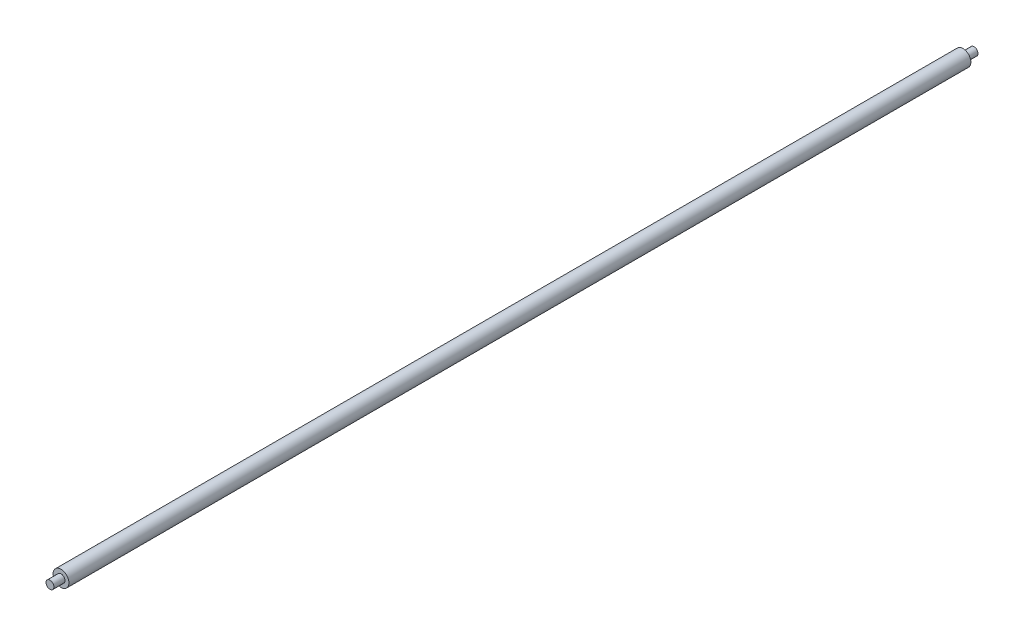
from build123d import *

# Parameters (mm, degrees)
SKIZZE1_R                       = 5
AUFSATZ_LINEAR_AUSTRAGEN1_DEPTH = 570
SKIZZE2_R                       = 2.5
AUFSATZ_LINEAR_AUSTRAGEN2_DEPTH = 7
AUFSATZ_LINEAR_START            = 7
SKIZZE3_R                       = 2.5
AUFSATZ_LINEAR_AUSTRAGEN3_DEPTH = 7


with BuildPart() as part:
    # Skizze1 → Aufsatz-Linear austragen1 (new body)
    with BuildSketch(Plane.XY):
        Circle(SKIZZE1_R)
    extrude(amount=AUFSATZ_LINEAR_AUSTRAGEN1_DEPTH)

    # Skizze2 → Aufsatz-Linear austragen2 (add)
    with BuildSketch(Plane(origin=(0, 0, 0), x_dir=(-1, 0, 0), z_dir=(0, 0, -1))):
        with Locations(Location((0, 0, 0), (0, 0, 180))):
            Circle(SKIZZE2_R)
    extrude(amount=AUFSATZ_LINEAR_AUSTRAGEN2_DEPTH)

    # Skizze3 → Aufsatz-Linear austragen3 (add)
    with BuildSketch(Plane.XY.offset(570).offset(AUFSATZ_LINEAR_START)):
        Circle(SKIZZE3_R)
    extrude(amount=-AUFSATZ_LINEAR_AUSTRAGEN3_DEPTH)


solid = part.part
